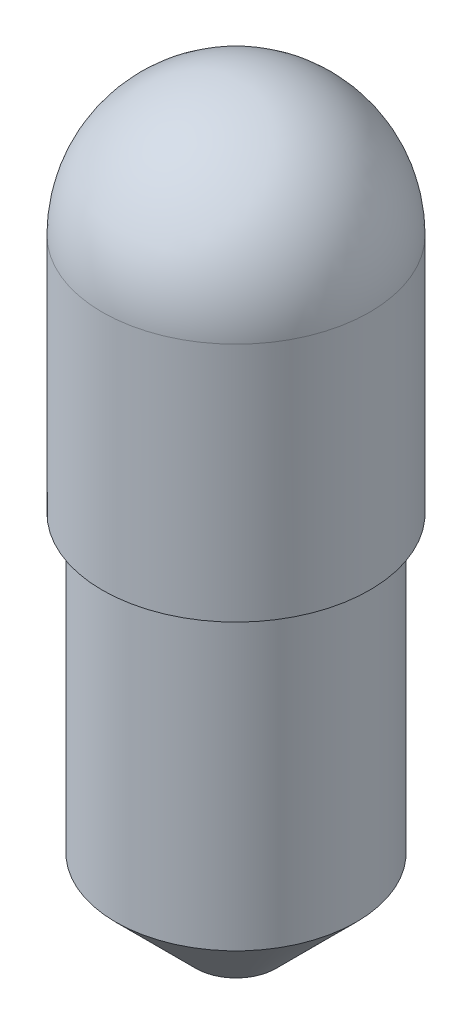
ISO-10303-21;
HEADER;
FILE_DESCRIPTION(('STEP AP214'),'2;1');
FILE_NAME('part.step','',(''),(''),'','','');
FILE_SCHEMA(('AUTOMOTIVE_DESIGN { 1 0 10303 214 1 1 1 1 }'));
ENDSEC;
DATA;
#1=APPLICATION_CONTEXT('core data for automotive mechanical design processes');
#2=APPLICATION_PROTOCOL_DEFINITION('international standard','automotive_design',2000,#1);
#3=PRODUCT_CONTEXT('',#1,'mechanical');
#4=PRODUCT('Part','Part','',(#3));
#5=PRODUCT_RELATED_PRODUCT_CATEGORY('part','',(#4));
#6=PRODUCT_DEFINITION_FORMATION('','',#4);
#7=PRODUCT_DEFINITION_CONTEXT('part definition',#1,'design');
#8=PRODUCT_DEFINITION('design','',#6,#7);
#9=PRODUCT_DEFINITION_SHAPE('','',#8);
#10=(LENGTH_UNIT() NAMED_UNIT(*) SI_UNIT(.MILLI.,.METRE.));
#11=(NAMED_UNIT(*) PLANE_ANGLE_UNIT() SI_UNIT($,.RADIAN.));
#12=(NAMED_UNIT(*) SI_UNIT($,.STERADIAN.) SOLID_ANGLE_UNIT());
#13=UNCERTAINTY_MEASURE_WITH_UNIT(LENGTH_MEASURE(1.E-05),#10,'distance_accuracy_value','');
#14=(GEOMETRIC_REPRESENTATION_CONTEXT(3) GLOBAL_UNCERTAINTY_ASSIGNED_CONTEXT((#13)) GLOBAL_UNIT_ASSIGNED_CONTEXT((#10,
#11,#12)) REPRESENTATION_CONTEXT('',''));
#15=CARTESIAN_POINT('',(0.,0.,0.));
#16=DIRECTION('',(0.,0.,1.));
#17=DIRECTION('',(1.,0.,0.));
#18=AXIS2_PLACEMENT_3D('',#15,#16,#17);
#19=CARTESIAN_POINT('',(0.,0.,0.));
#20=DIRECTION('',(0.,-1.,0.));
#21=DIRECTION('',(0.,0.,-1.));
#22=AXIS2_PLACEMENT_3D('',#19,#20,#21);
#23=PLANE('',#22);
#24=CARTESIAN_POINT('',(0.,0.,0.));
#25=DIRECTION('',(0.,1.,0.));
#26=DIRECTION('',(0.,0.,1.));
#27=AXIS2_PLACEMENT_3D('',#24,#25,#26);
#28=CIRCLE('',#27,1.5);
#29=CARTESIAN_POINT('',(0.,0.,1.5));
#30=VERTEX_POINT('',#29);
#31=EDGE_CURVE('E10',#30,#30,#28,.T.);
#32=ORIENTED_EDGE('',*,*,#31,.F.);
#33=EDGE_LOOP('',(#32));
#34=FACE_BOUND('',#33,.T.);
#35=ADVANCED_FACE('F31',(#34),#23,.T.);
#36=CARTESIAN_POINT('',(0.,3.,0.));
#37=DIRECTION('',(0.,1.,0.));
#38=DIRECTION('',(0.,0.,1.));
#39=AXIS2_PLACEMENT_3D('',#36,#37,#38);
#40=CONICAL_SURFACE('',#39,4.49999999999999,0.785398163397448);
#41=CARTESIAN_POINT('',(0.,3.,0.));
#42=DIRECTION('',(0.,1.,0.));
#43=DIRECTION('',(0.,0.,1.));
#44=AXIS2_PLACEMENT_3D('',#41,#42,#43);
#45=CIRCLE('',#44,4.49999999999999);
#46=CARTESIAN_POINT('',(0.,3.,4.49999999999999));
#47=VERTEX_POINT('',#46);
#48=EDGE_CURVE('E37',#47,#47,#45,.T.);
#49=CARTESIAN_POINT('',(0.,0.,1.5));
#50=CARTESIAN_POINT('',(0.,0.0312500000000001,1.53125));
#51=CARTESIAN_POINT('',(0.,0.0625000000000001,1.5625));
#52=CARTESIAN_POINT('',(0.,0.125,1.625));
#53=CARTESIAN_POINT('',(0.,0.15625,1.65625));
#54=CARTESIAN_POINT('',(0.,0.21875,1.71875));
#55=CARTESIAN_POINT('',(0.,0.25,1.75));
#56=CARTESIAN_POINT('',(0.,0.312499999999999,1.8125));
#57=CARTESIAN_POINT('',(0.,0.343749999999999,1.84375));
#58=CARTESIAN_POINT('',(0.,0.40625,1.90625));
#59=CARTESIAN_POINT('',(0.,0.4375,1.9375));
#60=CARTESIAN_POINT('',(0.,0.499999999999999,2.));
#61=CARTESIAN_POINT('',(0.,0.531249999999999,2.03125));
#62=CARTESIAN_POINT('',(0.,0.593749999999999,2.09375));
#63=CARTESIAN_POINT('',(0.,0.624999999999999,2.125));
#64=CARTESIAN_POINT('',(0.,0.687499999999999,2.1875));
#65=CARTESIAN_POINT('',(0.,0.718749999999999,2.21875));
#66=CARTESIAN_POINT('',(0.,0.781249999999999,2.28125));
#67=CARTESIAN_POINT('',(0.,0.812499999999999,2.3125));
#68=CARTESIAN_POINT('',(0.,0.874999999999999,2.375));
#69=CARTESIAN_POINT('',(0.,0.906249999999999,2.40625));
#70=CARTESIAN_POINT('',(0.,0.968749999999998,2.46875));
#71=CARTESIAN_POINT('',(0.,0.999999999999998,2.5));
#72=CARTESIAN_POINT('',(0.,1.0625,2.5625));
#73=CARTESIAN_POINT('',(0.,1.09375,2.59375));
#74=CARTESIAN_POINT('',(0.,1.15625,2.65625));
#75=CARTESIAN_POINT('',(0.,1.1875,2.6875));
#76=CARTESIAN_POINT('',(0.,1.25,2.75));
#77=CARTESIAN_POINT('',(0.,1.28125,2.78125));
#78=CARTESIAN_POINT('',(0.,1.34375,2.84375));
#79=CARTESIAN_POINT('',(0.,1.375,2.875));
#80=CARTESIAN_POINT('',(0.,1.4375,2.9375));
#81=CARTESIAN_POINT('',(0.,1.46875,2.96875));
#82=CARTESIAN_POINT('',(0.,1.53125,3.03125));
#83=CARTESIAN_POINT('',(0.,1.5625,3.0625));
#84=CARTESIAN_POINT('',(0.,1.625,3.125));
#85=CARTESIAN_POINT('',(0.,1.65625,3.15625));
#86=CARTESIAN_POINT('',(0.,1.71875,3.21875));
#87=CARTESIAN_POINT('',(0.,1.75,3.25));
#88=CARTESIAN_POINT('',(0.,1.8125,3.3125));
#89=CARTESIAN_POINT('',(0.,1.84375,3.34375));
#90=CARTESIAN_POINT('',(0.,1.90625,3.40625));
#91=CARTESIAN_POINT('',(0.,1.9375,3.4375));
#92=CARTESIAN_POINT('',(0.,2.,3.5));
#93=CARTESIAN_POINT('',(0.,2.03125,3.53125));
#94=CARTESIAN_POINT('',(0.,2.09375,3.59375));
#95=CARTESIAN_POINT('',(0.,2.125,3.625));
#96=CARTESIAN_POINT('',(0.,2.1875,3.6875));
#97=CARTESIAN_POINT('',(0.,2.21875,3.71875));
#98=CARTESIAN_POINT('',(0.,2.28125,3.78125));
#99=CARTESIAN_POINT('',(0.,2.3125,3.8125));
#100=CARTESIAN_POINT('',(0.,2.375,3.875));
#101=CARTESIAN_POINT('',(0.,2.40625,3.90625));
#102=CARTESIAN_POINT('',(0.,2.46875,3.96875));
#103=CARTESIAN_POINT('',(0.,2.5,3.99999999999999));
#104=CARTESIAN_POINT('',(0.,2.5625,4.06249999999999));
#105=CARTESIAN_POINT('',(0.,2.59375,4.09374999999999));
#106=CARTESIAN_POINT('',(0.,2.65625,4.15624999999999));
#107=CARTESIAN_POINT('',(0.,2.6875,4.18749999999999));
#108=CARTESIAN_POINT('',(0.,2.75,4.24999999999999));
#109=CARTESIAN_POINT('',(0.,2.78125,4.28125));
#110=CARTESIAN_POINT('',(0.,2.84375,4.34375));
#111=CARTESIAN_POINT('',(0.,2.875,4.37499999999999));
#112=CARTESIAN_POINT('',(0.,2.9375,4.43749999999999));
#113=CARTESIAN_POINT('',(0.,2.96875,4.46874999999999));
#114=CARTESIAN_POINT('',(0.,3.,4.49999999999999));
#115=B_SPLINE_CURVE_WITH_KNOTS('',3,(#49,#50,#51,#52,#53,#54,#55,#56,#57,#58,#59,#60,#61,#62,
#63,#64,#65,#66,#67,#68,#69,#70,#71,#72,#73,#74,#75,#76,#77,#78,#79,#80,#81,#82,#83,#84,#85,#86,
#87,#88,#89,#90,#91,#92,#93,#94,#95,#96,#97,#98,#99,#100,#101,#102,#103,#104,#105,#106,#107,
#108,#109,#110,#111,#112,#113,#114),.UNSPECIFIED.,.F.,.F.,(4,2,2,2,2,2,2,2,2,2,2,2,2,2,2,2,2,2,
2,2,2,2,2,2,2,2,2,2,2,2,2,2,4),(0.,0.132582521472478,0.265165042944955,0.397747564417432,
0.53033008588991,0.662912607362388,0.795495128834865,0.928077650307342,1.06066017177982,
1.1932426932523,1.32582521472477,1.45840773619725,1.59099025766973,1.72357277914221,
1.85615530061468,1.98873782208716,2.12132034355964,2.25390286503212,2.38648538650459,
2.51906790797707,2.65165042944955,2.78423295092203,2.9168154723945,3.04939799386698,
3.18198051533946,3.31456303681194,3.44714555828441,3.57972807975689,3.71231060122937,
3.84489312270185,3.97747564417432,4.1100581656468,4.24264068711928),.UNSPECIFIED.);
#116=EDGE_CURVE('BSEAM70',#30,#47,#115,.T.);
#117=ORIENTED_EDGE('',*,*,#31,.T.);
#118=ORIENTED_EDGE('',*,*,#48,.F.);
#119=ORIENTED_EDGE('',*,*,#116,.T.);
#120=ORIENTED_EDGE('',*,*,#116,.F.);
#121=EDGE_LOOP('',(#117,#119,#118,#120));
#122=FACE_BOUND('',#121,.T.);
#123=ADVANCED_FACE('F70',(#122),#40,.T.);
#124=CARTESIAN_POINT('',(0.,45.351884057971,0.));
#125=DIRECTION('',(0.,1.,0.));
#126=DIRECTION('',(0.,0.,1.));
#127=AXIS2_PLACEMENT_3D('',#124,#125,#126);
#128=CYLINDRICAL_SURFACE('',#127,4.49999999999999);
#129=ORIENTED_EDGE('',*,*,#48,.T.);
#130=EDGE_LOOP('',(#129));
#131=FACE_BOUND('',#130,.T.);
#132=CARTESIAN_POINT('',(0.,14.,0.));
#133=DIRECTION('',(0.,1.,0.));
#134=DIRECTION('',(0.,0.,1.));
#135=AXIS2_PLACEMENT_3D('',#132,#133,#134);
#136=CIRCLE('',#135,4.49999999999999);
#137=CARTESIAN_POINT('',(0.,14.,4.49999999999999));
#138=VERTEX_POINT('',#137);
#139=EDGE_CURVE('E41',#138,#138,#136,.T.);
#140=ORIENTED_EDGE('',*,*,#139,.F.);
#141=EDGE_LOOP('',(#140));
#142=FACE_BOUND('',#141,.T.);
#143=ADVANCED_FACE('F66',(#131,#142),#128,.T.);
#144=CARTESIAN_POINT('',(-5.,14.,0.));
#145=DIRECTION('',(0.,-1.,0.));
#146=DIRECTION('',(0.,0.,-1.));
#147=AXIS2_PLACEMENT_3D('',#144,#145,#146);
#148=PLANE('',#147);
#149=ORIENTED_EDGE('',*,*,#139,.T.);
#150=EDGE_LOOP('',(#149));
#151=FACE_BOUND('',#150,.T.);
#152=CARTESIAN_POINT('',(0.,14.,0.));
#153=DIRECTION('',(0.,1.,0.));
#154=DIRECTION('',(0.,0.,1.));
#155=AXIS2_PLACEMENT_3D('',#152,#153,#154);
#156=CIRCLE('',#155,5.);
#157=CARTESIAN_POINT('',(0.,14.,5.));
#158=VERTEX_POINT('',#157);
#159=EDGE_CURVE('E45',#158,#158,#156,.T.);
#160=ORIENTED_EDGE('',*,*,#159,.F.);
#161=EDGE_LOOP('',(#160));
#162=FACE_BOUND('',#161,.T.);
#163=ADVANCED_FACE('F58',(#151,#162),#148,.T.);
#164=CARTESIAN_POINT('',(0.,45.351884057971,0.));
#165=DIRECTION('',(0.,1.,0.));
#166=DIRECTION('',(0.,0.,1.));
#167=AXIS2_PLACEMENT_3D('',#164,#165,#166);
#168=CYLINDRICAL_SURFACE('',#167,5.);
#169=ORIENTED_EDGE('',*,*,#159,.T.);
#170=EDGE_LOOP('',(#169));
#171=FACE_BOUND('',#170,.T.);
#172=CARTESIAN_POINT('',(0.,23.,0.));
#173=DIRECTION('',(0.,1.,0.));
#174=DIRECTION('',(0.,0.,1.));
#175=AXIS2_PLACEMENT_3D('',#172,#173,#174);
#176=CIRCLE('',#175,5.);
#177=CARTESIAN_POINT('',(0.,23.,5.));
#178=VERTEX_POINT('',#177);
#179=EDGE_CURVE('E50',#178,#178,#176,.T.);
#180=ORIENTED_EDGE('',*,*,#179,.F.);
#181=EDGE_LOOP('',(#180));
#182=FACE_BOUND('',#181,.T.);
#183=ADVANCED_FACE('F56',(#171,#182),#168,.T.);
#184=CARTESIAN_POINT('',(0.,23.,0.));
#185=DIRECTION('',(0.,1.,0.));
#186=DIRECTION('',(-1.,0.,0.));
#187=AXIS2_PLACEMENT_3D('',#184,#185,#186);
#188=SPHERICAL_SURFACE('',#187,5.);
#189=ORIENTED_EDGE('',*,*,#179,.T.);
#190=EDGE_LOOP('',(#189));
#191=FACE_BOUND('',#190,.T.);
#192=ADVANCED_FACE('F54',(#191),#188,.T.);
#193=CLOSED_SHELL('',(#35,#123,#143,#163,#183,#192));
#194=MANIFOLD_SOLID_BREP('B2',#193);
#195=ADVANCED_BREP_SHAPE_REPRESENTATION('',(#18,#194),#14);
#196=SHAPE_DEFINITION_REPRESENTATION(#9,#195);
ENDSEC;
END-ISO-10303-21;
